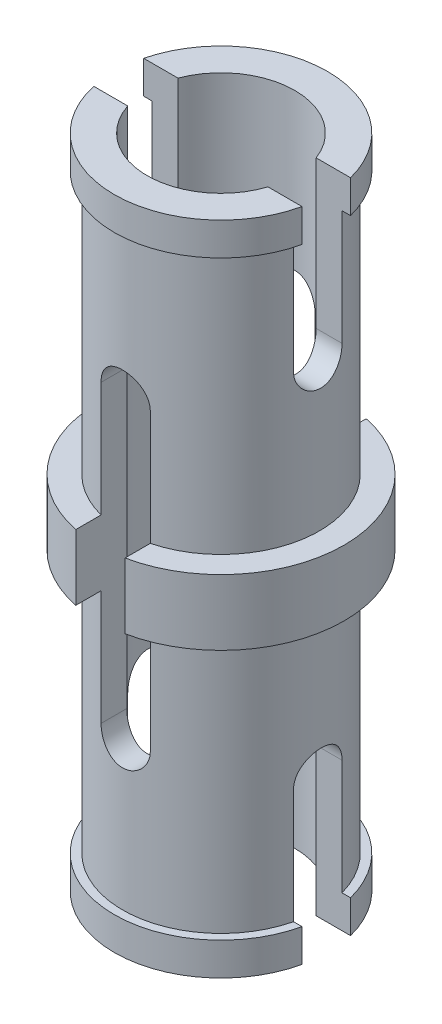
from build123d import *

# Parameters (mm, degrees)
BOSS_EXTRUDE1_DEPTH            = 8
BOSS_EXTRUDE1_DEPTH_BACK       = 8
SKETCH1_R                      = 2.4
BOSS_EXTRUDE2_DEPTH            = 0.8
BOSS_EXTRUDE2_DEPTH_BACK       = 0.8
SKETCH2_R                      = 3
SKETCH4_R                      = 2.6
BOSS_EXTRUDE3_DEPTH            = 0.8
BOSS_EXTRUDE5_START            = -0.8
SKETCH6_R                      = 2.6
BOSS_EXTRUDE5_DEPTH            = 0.8
CUT_EXTRUDE2_REACH             = 18.553
SKETCH7_R                      = 1.8
CUT_EXTRUDE3_REACH             = 11.055
CUT_EXTRUDE3_DIRECTION_2_REACH = 11.055
CUT_EXTRUDE4_REACH             = 11.035
CUT_EXTRUDE4_DIRECTION_2_REACH = 11.035


with BuildPart() as part:
    # Sketch1 → Boss-Extrude1 (new, two sides: drawn at the far end of the back side and taken through both)
    with BuildSketch(Plane(origin=(0, 0, 0), x_dir=(1, 0, 0), z_dir=(0, 1, 0)).offset(-BOSS_EXTRUDE1_DEPTH_BACK)):
        with Locations(Location((0, 0, 0), (0, 0, 270))):
            Circle(SKETCH1_R)
    extrude(amount=BOSS_EXTRUDE1_DEPTH + BOSS_EXTRUDE1_DEPTH_BACK)

    # Sketch2 → Boss-Extrude2 (add, two sides: drawn at the far end of the back side and taken through both)
    with BuildSketch(Plane(origin=(0, 0, 0), x_dir=(1, 0, 0), z_dir=(0, 1, 0)).offset(-BOSS_EXTRUDE2_DEPTH_BACK)):
        with Locations(Location((0, 0, 0), (0, 0, 270))):
            Circle(SKETCH2_R)
    extrude(amount=BOSS_EXTRUDE2_DEPTH + BOSS_EXTRUDE2_DEPTH_BACK)

    # Sketch4 → Boss-Extrude3 (add)
    with BuildSketch(Plane(origin=(0, 8, 0), x_dir=(1, 0, 0), z_dir=(0, 1, 0))):
        with Locations(Location((0, 0, 0), (0, 0, 270))):
            Circle(SKETCH4_R)
    extrude(amount=-BOSS_EXTRUDE3_DEPTH)

    # Sketch6 → Boss-Extrude5 (add)
    with BuildSketch(Plane.XZ.offset(8).offset(BOSS_EXTRUDE5_START)):
        with Locations(Location((0, 0, 0), (0, 0, 90))):
            Circle(SKETCH6_R)
    extrude(amount=BOSS_EXTRUDE5_DEPTH)

    # Sketch7 → Cut-Extrude2 (cut, up to next)
    with BuildSketch(Plane(origin=(0, 8, 0), x_dir=(1, 0, 0), z_dir=(0, 1, 0)), mode=Mode.PRIVATE) as cut_extrude2_sk1:
        with Locations(Location((0, 0, 0), (0, 0, 270))):
            Circle(SKETCH7_R)
    cut_extrude2_tool1 = extrude(cut_extrude2_sk1.sketch, amount=-CUT_EXTRUDE2_REACH, mode=Mode.PRIVATE) & part.part
    add(cut_extrude2_tool1.solids().sort_by_distance((0, 8, 0))[0], mode=Mode.SUBTRACT)

    # Sketch8 → Cut-Extrude3 (cut, up to next)
    with BuildSketch(Plane.XY, mode=Mode.PRIVATE) as cut_extrude3_sk1:
        with BuildLine():
            Line((-0.6, 3.6), (-0.6, -3.6))
            ThreePointArc((-0.6, -3.6), (0, -4.2), (0.6, -3.6))
            Line((0.6, -3.6), (0.6, 3.6))
            ThreePointArc((0.6, 3.6), (0, 4.2), (-0.6, 3.6))
        make_face()
    cut_extrude3_tool1 = extrude(cut_extrude3_sk1.sketch, amount=-CUT_EXTRUDE3_REACH, mode=Mode.PRIVATE) & part.part
    add(cut_extrude3_tool1.solids().sort_by_distance((0, 0, 0))[0], mode=Mode.SUBTRACT)

    # Sketch8 → Cut-Extrude3 direction 2 (cut, up to next)
    with BuildSketch(Plane.XY, mode=Mode.PRIVATE) as cut_extrude3_direction_2_sk1:
        with BuildLine():
            Line((-0.6, 3.6), (-0.6, -3.6))
            ThreePointArc((-0.6, -3.6), (0, -4.2), (0.6, -3.6))
            Line((0.6, -3.6), (0.6, 3.6))
            ThreePointArc((0.6, 3.6), (0, 4.2), (-0.6, 3.6))
        make_face()
    cut_extrude3_direction_2_tool1 = extrude(cut_extrude3_direction_2_sk1.sketch, amount=CUT_EXTRUDE3_DIRECTION_2_REACH, mode=Mode.PRIVATE) & part.part
    add(cut_extrude3_direction_2_tool1.solids().sort_by_distance((0, 0, 0))[0], mode=Mode.SUBTRACT)

    # Sketch9 → Cut-Extrude4 (cut, up to next)
    with BuildSketch(Plane(origin=(0, 0, 0), x_dir=(0, 0, -1), z_dir=(1, 0, 0)), mode=Mode.PRIVATE) as cut_extrude4_sk1:
        with BuildLine():
            Line((-0.563999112, 8), (-0.563999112, 4.4))
            ThreePointArc((-0.563999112, 4.4), (0.036000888, 3.8), (0.636000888, 4.4))
            Line((0.636000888, 4.4), (0.636000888, 8))
            Line((0.636000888, 8), (-0.563999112, 8))
        make_face()
    cut_extrude4_tool1 = extrude(cut_extrude4_sk1.sketch, amount=-CUT_EXTRUDE4_REACH, mode=Mode.PRIVATE) & part.part
    # Sketch9 → Cut-Extrude4 (cut, up to next)
    with BuildSketch(Plane(origin=(0, 0, 0), x_dir=(0, 0, -1), z_dir=(1, 0, 0)), mode=Mode.PRIVATE) as cut_extrude4_sk2:
        with BuildLine():
            Line((-0.563999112, -8), (-0.563999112, -4.4))
            ThreePointArc((-0.563999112, -4.4), (0.036000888, -3.8), (0.636000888, -4.4))
            Line((0.636000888, -4.4), (0.636000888, -8))
            Line((0.636000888, -8), (-0.563999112, -8))
        make_face()
    cut_extrude4_tool2 = extrude(cut_extrude4_sk2.sketch, amount=-CUT_EXTRUDE4_REACH, mode=Mode.PRIVATE) & part.part
    add(cut_extrude4_tool1.solids().sort_by_distance((0, 5.962178, -0.036001))[0], mode=Mode.SUBTRACT)
    add(cut_extrude4_tool2.solids().sort_by_distance((0, -5.962178, -0.036001))[0], mode=Mode.SUBTRACT)

    # Sketch9 → Cut-Extrude4 direction 2 (cut, up to next)
    with BuildSketch(Plane(origin=(0, 0, 0), x_dir=(0, 0, -1), z_dir=(1, 0, 0)), mode=Mode.PRIVATE) as cut_extrude4_direction_2_sk1:
        with BuildLine():
            Line((-0.563999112, 8), (-0.563999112, 4.4))
            ThreePointArc((-0.563999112, 4.4), (0.036000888, 3.8), (0.636000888, 4.4))
            Line((0.636000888, 4.4), (0.636000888, 8))
            Line((0.636000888, 8), (-0.563999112, 8))
        make_face()
    cut_extrude4_direction_2_tool1 = extrude(cut_extrude4_direction_2_sk1.sketch, amount=CUT_EXTRUDE4_DIRECTION_2_REACH, mode=Mode.PRIVATE) & part.part
    # Sketch9 → Cut-Extrude4 direction 2 (cut, up to next)
    with BuildSketch(Plane(origin=(0, 0, 0), x_dir=(0, 0, -1), z_dir=(1, 0, 0)), mode=Mode.PRIVATE) as cut_extrude4_direction_2_sk2:
        with BuildLine():
            Line((-0.563999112, -8), (-0.563999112, -4.4))
            ThreePointArc((-0.563999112, -4.4), (0.036000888, -3.8), (0.636000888, -4.4))
            Line((0.636000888, -4.4), (0.636000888, -8))
            Line((0.636000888, -8), (-0.563999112, -8))
        make_face()
    cut_extrude4_direction_2_tool2 = extrude(cut_extrude4_direction_2_sk2.sketch, amount=CUT_EXTRUDE4_DIRECTION_2_REACH, mode=Mode.PRIVATE) & part.part
    add(cut_extrude4_direction_2_tool1.solids().sort_by_distance((0, 5.962178, -0.036001))[0], mode=Mode.SUBTRACT)
    add(cut_extrude4_direction_2_tool2.solids().sort_by_distance((0, -5.962178, -0.036001))[0], mode=Mode.SUBTRACT)


solid = part.part
